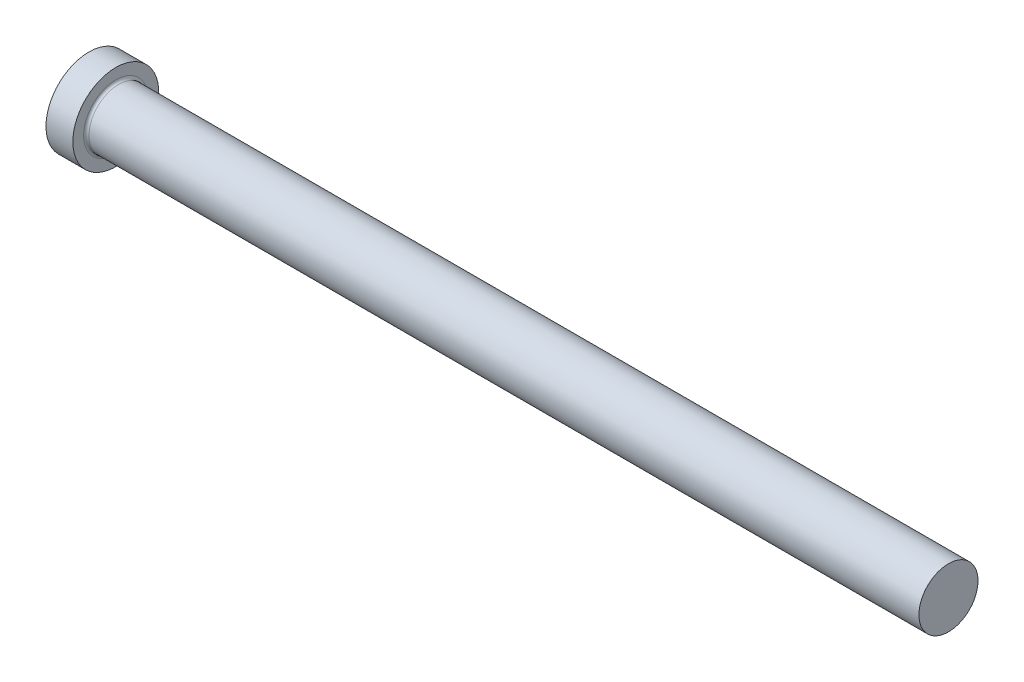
ISO-10303-21;
HEADER;
FILE_DESCRIPTION(('STEP AP214'),'2;1');
FILE_NAME('part.step','',(''),(''),'','','');
FILE_SCHEMA(('AUTOMOTIVE_DESIGN { 1 0 10303 214 1 1 1 1 }'));
ENDSEC;
DATA;
#1=APPLICATION_CONTEXT('core data for automotive mechanical design processes');
#2=APPLICATION_PROTOCOL_DEFINITION('international standard','automotive_design',2000,#1);
#3=PRODUCT_CONTEXT('',#1,'mechanical');
#4=PRODUCT('Part','Part','',(#3));
#5=PRODUCT_RELATED_PRODUCT_CATEGORY('part','',(#4));
#6=PRODUCT_DEFINITION_FORMATION('','',#4);
#7=PRODUCT_DEFINITION_CONTEXT('part definition',#1,'design');
#8=PRODUCT_DEFINITION('design','',#6,#7);
#9=PRODUCT_DEFINITION_SHAPE('','',#8);
#10=(LENGTH_UNIT() NAMED_UNIT(*) SI_UNIT(.MILLI.,.METRE.));
#11=(NAMED_UNIT(*) PLANE_ANGLE_UNIT() SI_UNIT($,.RADIAN.));
#12=(NAMED_UNIT(*) SI_UNIT($,.STERADIAN.) SOLID_ANGLE_UNIT());
#13=UNCERTAINTY_MEASURE_WITH_UNIT(LENGTH_MEASURE(1.E-05),#10,'distance_accuracy_value','');
#14=(GEOMETRIC_REPRESENTATION_CONTEXT(3) GLOBAL_UNCERTAINTY_ASSIGNED_CONTEXT((#13)) GLOBAL_UNIT_ASSIGNED_CONTEXT((#10,
#11,#12)) REPRESENTATION_CONTEXT('',''));
#15=CARTESIAN_POINT('',(0.,0.,0.));
#16=DIRECTION('',(0.,0.,1.));
#17=DIRECTION('',(1.,0.,0.));
#18=AXIS2_PLACEMENT_3D('',#15,#16,#17);
#19=CARTESIAN_POINT('',(0.,0.,0.));
#20=DIRECTION('',(-1.,0.,0.));
#21=DIRECTION('',(0.,-1.,0.));
#22=AXIS2_PLACEMENT_3D('',#19,#20,#21);
#23=PLANE('',#22);
#24=CARTESIAN_POINT('',(0.,0.,0.));
#25=DIRECTION('',(1.,0.,0.));
#26=DIRECTION('',(0.,1.,0.));
#27=AXIS2_PLACEMENT_3D('',#24,#25,#26);
#28=CIRCLE('',#27,8.);
#29=CARTESIAN_POINT('',(0.,8.,0.));
#30=VERTEX_POINT('',#29);
#31=EDGE_CURVE('E25',#30,#30,#28,.T.);
#32=ORIENTED_EDGE('',*,*,#31,.F.);
#33=EDGE_LOOP('',(#32));
#34=FACE_BOUND('',#33,.T.);
#35=ADVANCED_FACE('F14',(#34),#23,.T.);
#36=CARTESIAN_POINT('',(160.,0.,0.));
#37=DIRECTION('',(1.,0.,0.));
#38=DIRECTION('',(0.,1.,0.));
#39=AXIS2_PLACEMENT_3D('',#36,#37,#38);
#40=CYLINDRICAL_SURFACE('',#39,8.);
#41=ORIENTED_EDGE('',*,*,#31,.T.);
#42=EDGE_LOOP('',(#41));
#43=FACE_BOUND('',#42,.T.);
#44=CARTESIAN_POINT('',(5.,0.,0.));
#45=DIRECTION('',(1.,0.,0.));
#46=DIRECTION('',(0.,1.,0.));
#47=AXIS2_PLACEMENT_3D('',#44,#45,#46);
#48=CIRCLE('',#47,8.);
#49=CARTESIAN_POINT('',(5.,8.,0.));
#50=VERTEX_POINT('',#49);
#51=EDGE_CURVE('E29',#50,#50,#48,.T.);
#52=ORIENTED_EDGE('',*,*,#51,.F.);
#53=EDGE_LOOP('',(#52));
#54=FACE_BOUND('',#53,.T.);
#55=ADVANCED_FACE('F51',(#43,#54),#40,.T.);
#56=CARTESIAN_POINT('',(5.,8.,0.));
#57=DIRECTION('',(1.,0.,0.));
#58=DIRECTION('',(0.,1.,0.));
#59=AXIS2_PLACEMENT_3D('',#56,#57,#58);
#60=PLANE('',#59);
#61=CARTESIAN_POINT('',(5.,0.,0.));
#62=DIRECTION('',(1.,0.,0.));
#63=DIRECTION('',(0.,1.,0.));
#64=AXIS2_PLACEMENT_3D('',#61,#62,#63);
#65=CIRCLE('',#64,6.);
#66=CARTESIAN_POINT('',(5.,6.,0.));
#67=VERTEX_POINT('',#66);
#68=EDGE_CURVE('E9',#67,#67,#65,.F.);
#69=ORIENTED_EDGE('',*,*,#68,.T.);
#70=EDGE_LOOP('',(#69));
#71=FACE_BOUND('',#70,.T.);
#72=ORIENTED_EDGE('',*,*,#51,.T.);
#73=EDGE_LOOP('',(#72));
#74=FACE_BOUND('',#73,.T.);
#75=ADVANCED_FACE('F42',(#71,#74),#60,.T.);
#76=CARTESIAN_POINT('',(160.,0.,0.));
#77=DIRECTION('',(1.,0.,0.));
#78=DIRECTION('',(0.,1.,0.));
#79=AXIS2_PLACEMENT_3D('',#76,#77,#78);
#80=CYLINDRICAL_SURFACE('',#79,5.49999999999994);
#81=CARTESIAN_POINT('',(5.5,0.,0.));
#82=DIRECTION('',(1.,0.,0.));
#83=DIRECTION('',(0.,1.,0.));
#84=AXIS2_PLACEMENT_3D('',#81,#82,#83);
#85=CIRCLE('',#84,5.49999999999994);
#86=CARTESIAN_POINT('',(5.5,5.49999999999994,0.));
#87=VERTEX_POINT('',#86);
#88=EDGE_CURVE('E21',#87,#87,#85,.T.);
#89=ORIENTED_EDGE('',*,*,#88,.T.);
#90=EDGE_LOOP('',(#89));
#91=FACE_BOUND('',#90,.T.);
#92=CARTESIAN_POINT('',(160.,0.,0.));
#93=DIRECTION('',(1.,0.,0.));
#94=DIRECTION('',(0.,1.,0.));
#95=AXIS2_PLACEMENT_3D('',#92,#93,#94);
#96=CIRCLE('',#95,5.5);
#97=CARTESIAN_POINT('',(160.,5.5,0.));
#98=VERTEX_POINT('',#97);
#99=EDGE_CURVE('E34',#98,#98,#96,.T.);
#100=ORIENTED_EDGE('',*,*,#99,.F.);
#101=EDGE_LOOP('',(#100));
#102=FACE_BOUND('',#101,.T.);
#103=ADVANCED_FACE('F40',(#91,#102),#80,.T.);
#104=CARTESIAN_POINT('',(160.,5.5,0.));
#105=DIRECTION('',(1.,0.,0.));
#106=DIRECTION('',(0.,1.,0.));
#107=AXIS2_PLACEMENT_3D('',#104,#105,#106);
#108=PLANE('',#107);
#109=ORIENTED_EDGE('',*,*,#99,.T.);
#110=EDGE_LOOP('',(#109));
#111=FACE_BOUND('',#110,.T.);
#112=ADVANCED_FACE('F38',(#111),#108,.T.);
#113=CARTESIAN_POINT('',(5.5,0.,0.));
#114=DIRECTION('',(1.,0.,0.));
#115=DIRECTION('',(0.,1.,0.));
#116=AXIS2_PLACEMENT_3D('',#113,#114,#115);
#117=TOROIDAL_SURFACE('',#116,6.,0.5);
#118=ORIENTED_EDGE('',*,*,#68,.F.);
#119=EDGE_LOOP('',(#118));
#120=FACE_BOUND('',#119,.T.);
#121=ORIENTED_EDGE('',*,*,#88,.F.);
#122=EDGE_LOOP('',(#121));
#123=FACE_BOUND('',#122,.T.);
#124=ADVANCED_FACE('F16',(#120,#123),#117,.F.);
#125=CLOSED_SHELL('',(#35,#55,#75,#103,#112,#124));
#126=MANIFOLD_SOLID_BREP('B1',#125);
#127=ADVANCED_BREP_SHAPE_REPRESENTATION('',(#18,#126),#14);
#128=SHAPE_DEFINITION_REPRESENTATION(#9,#127);
ENDSEC;
END-ISO-10303-21;
